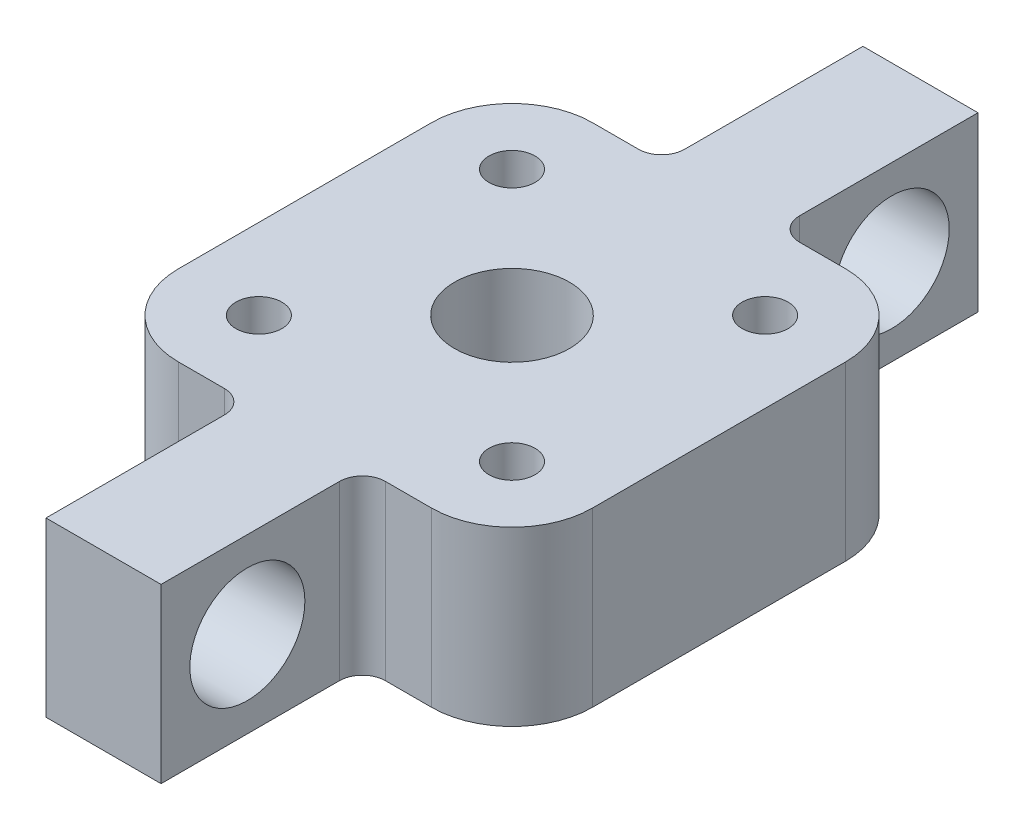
from build123d import *

# Parameters (mm, degrees)
SKETCH1_R           = 5
SKETCH1_R_2         = 2
BOSS_EXTRUDE1_DEPTH = 7.5
FILLET1_R           = 7
FILLET2_R           = 2
SKETCH3_R           = 5
CUT_EXTRUDE2_DEPTH  = 27


with BuildPart() as part:
    # Sketch1 → Boss-Extrude1 (new, symmetric)
    with BuildSketch(Plane(origin=(0, 0, 0), x_dir=(1, 0, 0), z_dir=(0, 1, 0))):
        Polygon((-5, 18), (-5, 35.5), (5, 35.5), (5, 18), (18, 18), (18, -18), (5, -18), (5, -35.5), (-5, -35.5), (-5, -18), (-18, -18), (-18, 18), align=None)
        with Locations(Location((0, 0, 0), (0, 0, 270))):
            Circle(SKETCH1_R, mode=Mode.SUBTRACT)
        with Locations(Location((-11, -11, 0), (0, 0, 270))):
            Circle(SKETCH1_R_2, mode=Mode.SUBTRACT)
        with Locations(Location((11, -11, 0), (0, 0, 270))):
            Circle(SKETCH1_R_2, mode=Mode.SUBTRACT)
        with Locations(Location((11, 11, 0), (0, 0, 270))):
            Circle(SKETCH1_R_2, mode=Mode.SUBTRACT)
        with Locations(Location((-11, 11, 0), (0, 0, 270))):
            Circle(SKETCH1_R_2, mode=Mode.SUBTRACT)
    extrude(amount=BOSS_EXTRUDE1_DEPTH, both=True)

    # Fillet1
    fillet1_edges = [part.edges().sort_by_distance(p)[0] for p in [
        (-18, 0, 18),
        (-18, 0, -18),
        (18, 0, -18),
        (18, 0, 18),
    ]]
    fillet(fillet1_edges, radius=FILLET1_R)

    # Fillet2
    fillet2_edges = [part.edges().sort_by_distance(p)[0] for p in [
        (-5, 0, -18),
        (5, 0, -18),
        (5, 0, 18),
        (-5, 0, 18),
    ]]
    fillet(fillet2_edges, radius=FILLET2_R)

    # Sketch3 → Cut-Extrude2 (cut)
    with BuildSketch(Plane(origin=(5, 0, 0), x_dir=(0, 0, -1), z_dir=(1, 0, 0))):
        with Locations((-28, 0)):
            Circle(SKETCH3_R)
        with Locations((28, 0)):
            Circle(SKETCH3_R)
    extrude(amount=-CUT_EXTRUDE2_DEPTH, mode=Mode.SUBTRACT)


solid = part.part
